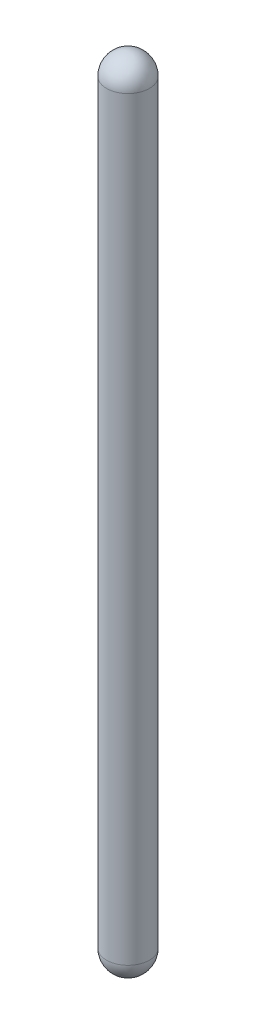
ISO-10303-21;
HEADER;
FILE_DESCRIPTION(('STEP AP214'),'2;1');
FILE_NAME('part.step','',(''),(''),'','','');
FILE_SCHEMA(('AUTOMOTIVE_DESIGN { 1 0 10303 214 1 1 1 1 }'));
ENDSEC;
DATA;
#1=APPLICATION_CONTEXT('core data for automotive mechanical design processes');
#2=APPLICATION_PROTOCOL_DEFINITION('international standard','automotive_design',2000,#1);
#3=PRODUCT_CONTEXT('',#1,'mechanical');
#4=PRODUCT('Part','Part','',(#3));
#5=PRODUCT_RELATED_PRODUCT_CATEGORY('part','',(#4));
#6=PRODUCT_DEFINITION_FORMATION('','',#4);
#7=PRODUCT_DEFINITION_CONTEXT('part definition',#1,'design');
#8=PRODUCT_DEFINITION('design','',#6,#7);
#9=PRODUCT_DEFINITION_SHAPE('','',#8);
#10=(LENGTH_UNIT() NAMED_UNIT(*) SI_UNIT(.MILLI.,.METRE.));
#11=(NAMED_UNIT(*) PLANE_ANGLE_UNIT() SI_UNIT($,.RADIAN.));
#12=(NAMED_UNIT(*) SI_UNIT($,.STERADIAN.) SOLID_ANGLE_UNIT());
#13=UNCERTAINTY_MEASURE_WITH_UNIT(LENGTH_MEASURE(1.E-05),#10,'distance_accuracy_value','');
#14=(GEOMETRIC_REPRESENTATION_CONTEXT(3) GLOBAL_UNCERTAINTY_ASSIGNED_CONTEXT((#13)) GLOBAL_UNIT_ASSIGNED_CONTEXT((#10,
#11,#12)) REPRESENTATION_CONTEXT('',''));
#15=CARTESIAN_POINT('',(0.,0.,0.));
#16=DIRECTION('',(0.,0.,1.));
#17=DIRECTION('',(1.,0.,0.));
#18=AXIS2_PLACEMENT_3D('',#15,#16,#17);
#19=CARTESIAN_POINT('',(0.,45.,0.));
#20=DIRECTION('',(0.,1.,0.));
#21=DIRECTION('',(0.,0.,-1.));
#22=AXIS2_PLACEMENT_3D('',#19,#20,#21);
#23=CYLINDRICAL_SURFACE('',#22,2.);
#24=CARTESIAN_POINT('',(0.,115.58,0.));
#25=DIRECTION('',(0.,-1.,0.));
#26=DIRECTION('',(1.,0.,0.));
#27=AXIS2_PLACEMENT_3D('',#24,#25,#26);
#28=CIRCLE('',#27,2.);
#29=CARTESIAN_POINT('',(0.,115.58,-2.));
#30=VERTEX_POINT('',#29);
#31=CARTESIAN_POINT('',(0.,115.58,2.));
#32=VERTEX_POINT('',#31);
#33=EDGE_CURVE('E11',#30,#32,#28,.T.);
#34=ORIENTED_EDGE('',*,*,#33,.T.);
#35=CARTESIAN_POINT('',(0.,115.58,0.));
#36=DIRECTION('',(0.,1.,0.));
#37=DIRECTION('',(-1.,0.,0.));
#38=AXIS2_PLACEMENT_3D('',#35,#36,#37);
#39=CIRCLE('',#38,2.);
#40=EDGE_CURVE('E24',#30,#32,#39,.T.);
#41=ORIENTED_EDGE('',*,*,#40,.F.);
#42=EDGE_LOOP('',(#34,#41));
#43=FACE_BOUND('',#42,.T.);
#44=CARTESIAN_POINT('',(0.,45.,0.));
#45=DIRECTION('',(0.,-1.,0.));
#46=DIRECTION('',(1.,0.,0.));
#47=AXIS2_PLACEMENT_3D('',#44,#45,#46);
#48=CIRCLE('',#47,2.);
#49=CARTESIAN_POINT('',(0.,45.,-2.));
#50=VERTEX_POINT('',#49);
#51=CARTESIAN_POINT('',(0.,45.,2.));
#52=VERTEX_POINT('',#51);
#53=EDGE_CURVE('E40',#50,#52,#48,.T.);
#54=ORIENTED_EDGE('',*,*,#53,.F.);
#55=CARTESIAN_POINT('',(0.,45.,0.));
#56=DIRECTION('',(0.,1.,0.));
#57=DIRECTION('',(-1.,0.,0.));
#58=AXIS2_PLACEMENT_3D('',#55,#56,#57);
#59=CIRCLE('',#58,2.);
#60=EDGE_CURVE('E30',#50,#52,#59,.T.);
#61=ORIENTED_EDGE('',*,*,#60,.T.);
#62=EDGE_LOOP('',(#54,#61));
#63=FACE_BOUND('',#62,.T.);
#64=ADVANCED_FACE('F16',(#43,#63),#23,.T.);
#65=CARTESIAN_POINT('',(0.,115.58,0.));
#66=DIRECTION('',(0.,0.,1.));
#67=DIRECTION('',(-1.,0.,0.));
#68=AXIS2_PLACEMENT_3D('',#65,#66,#67);
#69=SPHERICAL_SURFACE('',#68,2.);
#70=CARTESIAN_POINT('',(0.,115.58,0.));
#71=DIRECTION('',(0.,-1.,0.));
#72=DIRECTION('',(1.,0.,0.));
#73=AXIS2_PLACEMENT_3D('',#70,#71,#72);
#74=SPHERICAL_SURFACE('',#73,2.);
#75=ORIENTED_EDGE('',*,*,#33,.F.);
#76=ORIENTED_EDGE('',*,*,#40,.T.);
#77=EDGE_LOOP('',(#75,#76));
#78=FACE_BOUND('',#77,.T.);
#79=ADVANCED_FACE('F62',(#78),#74,.T.);
#80=CARTESIAN_POINT('',(0.,45.,0.));
#81=DIRECTION('',(0.,0.,1.));
#82=DIRECTION('',(1.,0.,0.));
#83=AXIS2_PLACEMENT_3D('',#80,#81,#82);
#84=SPHERICAL_SURFACE('',#83,2.);
#85=CARTESIAN_POINT('',(0.,45.,0.));
#86=DIRECTION('',(0.,1.,0.));
#87=DIRECTION('',(-1.,0.,0.));
#88=AXIS2_PLACEMENT_3D('',#85,#86,#87);
#89=SPHERICAL_SURFACE('',#88,2.);
#90=ORIENTED_EDGE('',*,*,#60,.F.);
#91=ORIENTED_EDGE('',*,*,#53,.T.);
#92=EDGE_LOOP('',(#90,#91));
#93=FACE_BOUND('',#92,.T.);
#94=ADVANCED_FACE('F41',(#93),#89,.T.);
#95=CLOSED_SHELL('',(#64,#79,#94));
#96=MANIFOLD_SOLID_BREP('B1',#95);
#97=ADVANCED_BREP_SHAPE_REPRESENTATION('',(#18,#96),#14);
#98=SHAPE_DEFINITION_REPRESENTATION(#9,#97);
ENDSEC;
END-ISO-10303-21;
